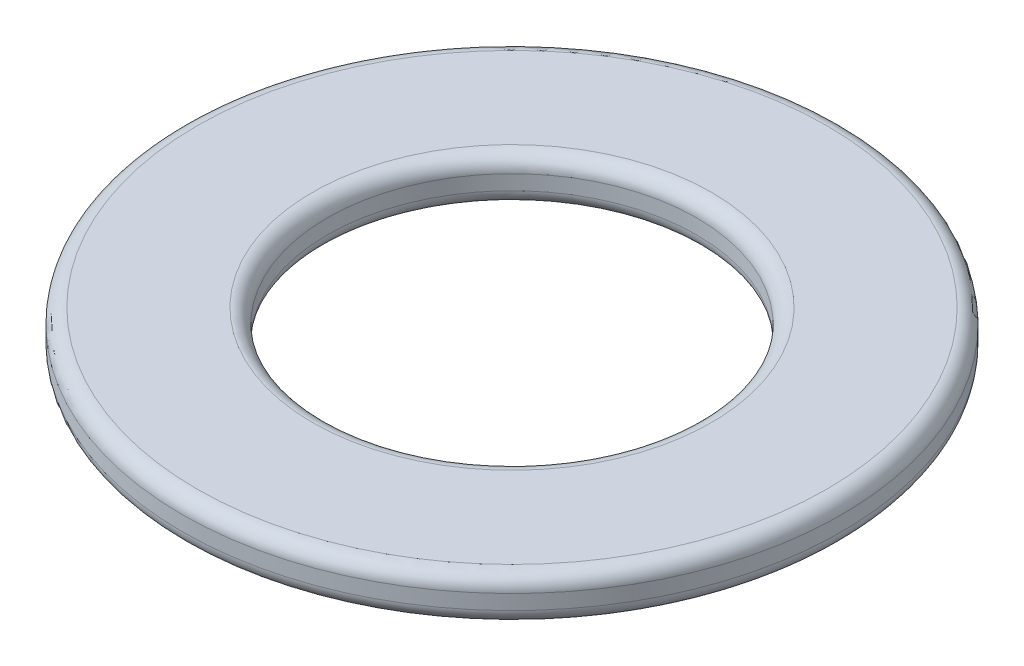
ISO-10303-21;
HEADER;
FILE_DESCRIPTION(('STEP AP214'),'2;1');
FILE_NAME('part.step','',(''),(''),'','','');
FILE_SCHEMA(('AUTOMOTIVE_DESIGN { 1 0 10303 214 1 1 1 1 }'));
ENDSEC;
DATA;
#1=APPLICATION_CONTEXT('core data for automotive mechanical design processes');
#2=APPLICATION_PROTOCOL_DEFINITION('international standard','automotive_design',2000,#1);
#3=PRODUCT_CONTEXT('',#1,'mechanical');
#4=PRODUCT('Part','Part','',(#3));
#5=PRODUCT_RELATED_PRODUCT_CATEGORY('part','',(#4));
#6=PRODUCT_DEFINITION_FORMATION('','',#4);
#7=PRODUCT_DEFINITION_CONTEXT('part definition',#1,'design');
#8=PRODUCT_DEFINITION('design','',#6,#7);
#9=PRODUCT_DEFINITION_SHAPE('','',#8);
#10=(LENGTH_UNIT() NAMED_UNIT(*) SI_UNIT(.MILLI.,.METRE.));
#11=(NAMED_UNIT(*) PLANE_ANGLE_UNIT() SI_UNIT($,.RADIAN.));
#12=(NAMED_UNIT(*) SI_UNIT($,.STERADIAN.) SOLID_ANGLE_UNIT());
#13=UNCERTAINTY_MEASURE_WITH_UNIT(LENGTH_MEASURE(1.E-05),#10,'distance_accuracy_value','');
#14=(GEOMETRIC_REPRESENTATION_CONTEXT(3) GLOBAL_UNCERTAINTY_ASSIGNED_CONTEXT((#13)) GLOBAL_UNIT_ASSIGNED_CONTEXT((#10,
#11,#12)) REPRESENTATION_CONTEXT('',''));
#15=CARTESIAN_POINT('',(0.,0.,0.));
#16=DIRECTION('',(0.,0.,1.));
#17=DIRECTION('',(1.,0.,0.));
#18=AXIS2_PLACEMENT_3D('',#15,#16,#17);
#19=CARTESIAN_POINT('',(0.,3.,0.));
#20=DIRECTION('',(0.,1.,0.));
#21=DIRECTION('',(0.,0.,1.));
#22=AXIS2_PLACEMENT_3D('',#19,#20,#21);
#23=PLANE('',#22);
#24=CARTESIAN_POINT('',(0.,3.,0.));
#25=DIRECTION('',(0.,1.,0.));
#26=DIRECTION('',(0.,0.,1.));
#27=AXIS2_PLACEMENT_3D('',#24,#25,#26);
#28=CIRCLE('',#27,13.5079534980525);
#29=CARTESIAN_POINT('',(0.,3.,13.5079534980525));
#30=VERTEX_POINT('',#29);
#31=EDGE_CURVE('E42',#30,#30,#28,.F.);
#32=ORIENTED_EDGE('',*,*,#31,.T.);
#33=EDGE_LOOP('',(#32));
#34=FACE_BOUND('',#33,.T.);
#35=CARTESIAN_POINT('',(0.,3.,0.));
#36=DIRECTION('',(0.,1.,0.));
#37=DIRECTION('',(0.,0.,1.));
#38=AXIS2_PLACEMENT_3D('',#35,#36,#37);
#39=CIRCLE('',#38,21.3169090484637);
#40=CARTESIAN_POINT('',(0.,3.,21.3169090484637));
#41=VERTEX_POINT('',#40);
#42=EDGE_CURVE('E60',#41,#41,#39,.T.);
#43=ORIENTED_EDGE('',*,*,#42,.T.);
#44=EDGE_LOOP('',(#43));
#45=FACE_BOUND('',#44,.T.);
#46=ADVANCED_FACE('F31',(#34,#45),#23,.T.);
#47=CARTESIAN_POINT('',(0.,0.,0.));
#48=DIRECTION('',(0.,1.,0.));
#49=DIRECTION('',(0.,0.,1.));
#50=AXIS2_PLACEMENT_3D('',#47,#48,#49);
#51=PLANE('',#50);
#52=CARTESIAN_POINT('',(0.,0.,0.));
#53=DIRECTION('',(0.,1.,0.));
#54=DIRECTION('',(0.,0.,1.));
#55=AXIS2_PLACEMENT_3D('',#52,#53,#54);
#56=CIRCLE('',#55,13.5079534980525);
#57=CARTESIAN_POINT('',(0.,0.,13.5079534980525));
#58=VERTEX_POINT('',#57);
#59=EDGE_CURVE('E38',#58,#58,#56,.T.);
#60=ORIENTED_EDGE('',*,*,#59,.T.);
#61=EDGE_LOOP('',(#60));
#62=FACE_BOUND('',#61,.T.);
#63=CARTESIAN_POINT('',(0.,0.,0.));
#64=DIRECTION('',(0.,1.,0.));
#65=DIRECTION('',(0.,0.,1.));
#66=AXIS2_PLACEMENT_3D('',#63,#64,#65);
#67=CIRCLE('',#66,21.3169090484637);
#68=CARTESIAN_POINT('',(0.,0.,21.3169090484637));
#69=VERTEX_POINT('',#68);
#70=EDGE_CURVE('E51',#69,#69,#67,.F.);
#71=ORIENTED_EDGE('',*,*,#70,.T.);
#72=EDGE_LOOP('',(#71));
#73=FACE_BOUND('',#72,.T.);
#74=ADVANCED_FACE('F83',(#62,#73),#51,.F.);
#75=CARTESIAN_POINT('',(0.,3.,0.));
#76=DIRECTION('',(0.,-1.,0.));
#77=DIRECTION('',(0.,0.,-1.));
#78=AXIS2_PLACEMENT_3D('',#75,#76,#77);
#79=CYLINDRICAL_SURFACE('',#78,22.3169090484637);
#80=CARTESIAN_POINT('',(0.,1.,0.));
#81=DIRECTION('',(0.,1.,0.));
#82=DIRECTION('',(0.,0.,1.));
#83=AXIS2_PLACEMENT_3D('',#80,#81,#82);
#84=CIRCLE('',#83,22.3169090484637);
#85=CARTESIAN_POINT('',(0.,1.,22.3169090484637));
#86=VERTEX_POINT('',#85);
#87=EDGE_CURVE('E54',#86,#86,#84,.T.);
#88=ORIENTED_EDGE('',*,*,#87,.T.);
#89=EDGE_LOOP('',(#88));
#90=FACE_BOUND('',#89,.T.);
#91=CARTESIAN_POINT('',(0.,2.,0.));
#92=DIRECTION('',(0.,1.,0.));
#93=DIRECTION('',(0.,0.,1.));
#94=AXIS2_PLACEMENT_3D('',#91,#92,#93);
#95=CIRCLE('',#94,22.3169090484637);
#96=CARTESIAN_POINT('',(0.,2.,22.3169090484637));
#97=VERTEX_POINT('',#96);
#98=EDGE_CURVE('E57',#97,#97,#95,.F.);
#99=ORIENTED_EDGE('',*,*,#98,.T.);
#100=EDGE_LOOP('',(#99));
#101=FACE_BOUND('',#100,.T.);
#102=ADVANCED_FACE('F78',(#90,#101),#79,.T.);
#103=CARTESIAN_POINT('',(0.,3.,0.));
#104=DIRECTION('',(0.,-1.,0.));
#105=DIRECTION('',(0.,0.,-1.));
#106=AXIS2_PLACEMENT_3D('',#103,#104,#105);
#107=CYLINDRICAL_SURFACE('',#106,12.5079534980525);
#108=CARTESIAN_POINT('',(0.,1.,0.));
#109=DIRECTION('',(0.,1.,0.));
#110=DIRECTION('',(0.,0.,1.));
#111=AXIS2_PLACEMENT_3D('',#108,#109,#110);
#112=CIRCLE('',#111,12.5079534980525);
#113=CARTESIAN_POINT('',(0.,1.,12.5079534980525));
#114=VERTEX_POINT('',#113);
#115=EDGE_CURVE('E10',#114,#114,#112,.F.);
#116=ORIENTED_EDGE('',*,*,#115,.T.);
#117=EDGE_LOOP('',(#116));
#118=FACE_BOUND('',#117,.T.);
#119=CARTESIAN_POINT('',(0.,2.,0.));
#120=DIRECTION('',(0.,1.,0.));
#121=DIRECTION('',(0.,0.,1.));
#122=AXIS2_PLACEMENT_3D('',#119,#120,#121);
#123=CIRCLE('',#122,12.5079534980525);
#124=CARTESIAN_POINT('',(0.,2.,12.5079534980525));
#125=VERTEX_POINT('',#124);
#126=EDGE_CURVE('E46',#125,#125,#123,.T.);
#127=ORIENTED_EDGE('',*,*,#126,.T.);
#128=EDGE_LOOP('',(#127));
#129=FACE_BOUND('',#128,.T.);
#130=ADVANCED_FACE('F68',(#118,#129),#107,.F.);
#131=CARTESIAN_POINT('',(0.,2.,0.));
#132=DIRECTION('',(0.,1.,0.));
#133=DIRECTION('',(0.,0.,1.));
#134=AXIS2_PLACEMENT_3D('',#131,#132,#133);
#135=TOROIDAL_SURFACE('',#134,21.3169090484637,1.);
#136=ORIENTED_EDGE('',*,*,#98,.F.);
#137=EDGE_LOOP('',(#136));
#138=FACE_BOUND('',#137,.T.);
#139=ORIENTED_EDGE('',*,*,#42,.F.);
#140=EDGE_LOOP('',(#139));
#141=FACE_BOUND('',#140,.T.);
#142=ADVANCED_FACE('F65',(#138,#141),#135,.T.);
#143=CARTESIAN_POINT('',(0.,1.,0.));
#144=DIRECTION('',(0.,1.,0.));
#145=DIRECTION('',(0.,0.,1.));
#146=AXIS2_PLACEMENT_3D('',#143,#144,#145);
#147=TOROIDAL_SURFACE('',#146,21.3169090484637,1.);
#148=ORIENTED_EDGE('',*,*,#70,.F.);
#149=EDGE_LOOP('',(#148));
#150=FACE_BOUND('',#149,.T.);
#151=ORIENTED_EDGE('',*,*,#87,.F.);
#152=EDGE_LOOP('',(#151));
#153=FACE_BOUND('',#152,.T.);
#154=ADVANCED_FACE('F67',(#150,#153),#147,.T.);
#155=CARTESIAN_POINT('',(0.,2.,0.));
#156=DIRECTION('',(0.,1.,0.));
#157=DIRECTION('',(0.,0.,1.));
#158=AXIS2_PLACEMENT_3D('',#155,#156,#157);
#159=TOROIDAL_SURFACE('',#158,13.5079534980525,1.);
#160=ORIENTED_EDGE('',*,*,#31,.F.);
#161=EDGE_LOOP('',(#160));
#162=FACE_BOUND('',#161,.T.);
#163=ORIENTED_EDGE('',*,*,#126,.F.);
#164=EDGE_LOOP('',(#163));
#165=FACE_BOUND('',#164,.T.);
#166=ADVANCED_FACE('F75',(#162,#165),#159,.T.);
#167=CARTESIAN_POINT('',(0.,1.,0.));
#168=DIRECTION('',(0.,1.,0.));
#169=DIRECTION('',(0.,0.,1.));
#170=AXIS2_PLACEMENT_3D('',#167,#168,#169);
#171=TOROIDAL_SURFACE('',#170,13.5079534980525,1.);
#172=ORIENTED_EDGE('',*,*,#115,.F.);
#173=EDGE_LOOP('',(#172));
#174=FACE_BOUND('',#173,.T.);
#175=ORIENTED_EDGE('',*,*,#59,.F.);
#176=EDGE_LOOP('',(#175));
#177=FACE_BOUND('',#176,.T.);
#178=ADVANCED_FACE('F33',(#174,#177),#171,.T.);
#179=CLOSED_SHELL('',(#46,#74,#102,#130,#142,#154,#166,#178));
#180=MANIFOLD_SOLID_BREP('B2',#179);
#181=ADVANCED_BREP_SHAPE_REPRESENTATION('',(#18,#180),#14);
#182=SHAPE_DEFINITION_REPRESENTATION(#9,#181);
ENDSEC;
END-ISO-10303-21;
